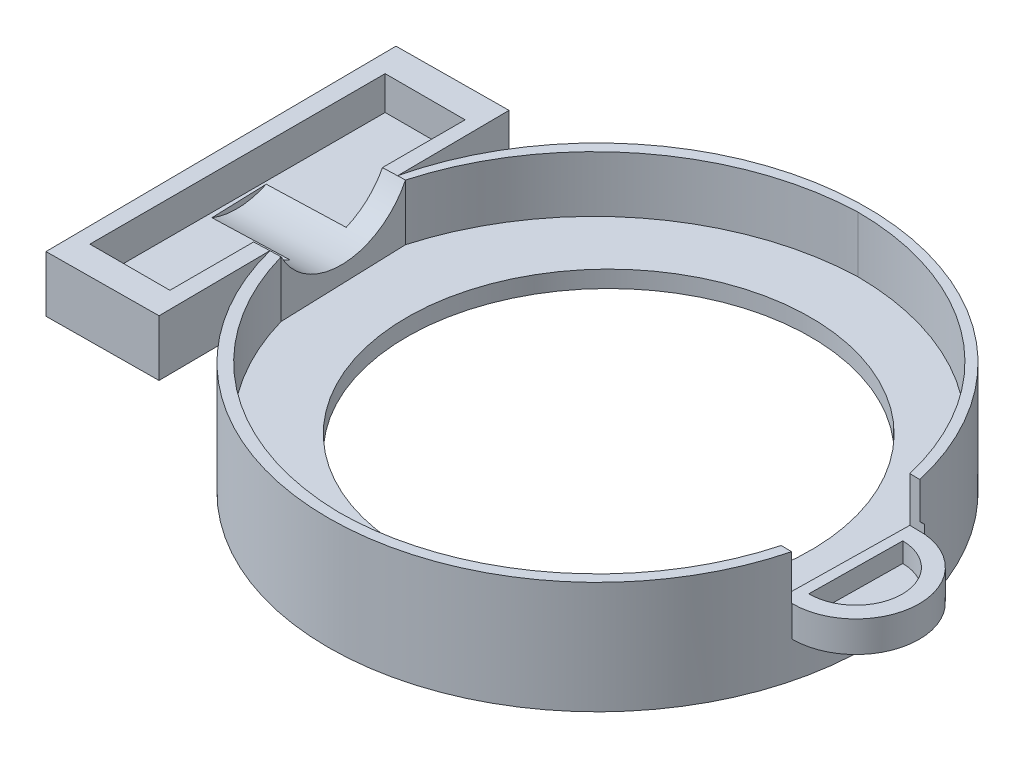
ISO-10303-21;
HEADER;
FILE_DESCRIPTION(('STEP AP214'),'2;1');
FILE_NAME('part.step','',(''),(''),'','','');
FILE_SCHEMA(('AUTOMOTIVE_DESIGN { 1 0 10303 214 1 1 1 1 }'));
ENDSEC;
DATA;
#1=APPLICATION_CONTEXT('core data for automotive mechanical design processes');
#2=APPLICATION_PROTOCOL_DEFINITION('international standard','automotive_design',2000,#1);
#3=PRODUCT_CONTEXT('',#1,'mechanical');
#4=PRODUCT('Part','Part','',(#3));
#5=PRODUCT_RELATED_PRODUCT_CATEGORY('part','',(#4));
#6=PRODUCT_DEFINITION_FORMATION('','',#4);
#7=PRODUCT_DEFINITION_CONTEXT('part definition',#1,'design');
#8=PRODUCT_DEFINITION('design','',#6,#7);
#9=PRODUCT_DEFINITION_SHAPE('','',#8);
#10=(LENGTH_UNIT() NAMED_UNIT(*) SI_UNIT(.MILLI.,.METRE.));
#11=(NAMED_UNIT(*) PLANE_ANGLE_UNIT() SI_UNIT($,.RADIAN.));
#12=(NAMED_UNIT(*) SI_UNIT($,.STERADIAN.) SOLID_ANGLE_UNIT());
#13=UNCERTAINTY_MEASURE_WITH_UNIT(LENGTH_MEASURE(1.E-05),#10,'distance_accuracy_value','');
#14=(GEOMETRIC_REPRESENTATION_CONTEXT(3) GLOBAL_UNCERTAINTY_ASSIGNED_CONTEXT((#13)) GLOBAL_UNIT_ASSIGNED_CONTEXT((#10,
#11,#12)) REPRESENTATION_CONTEXT('',''));
#15=CARTESIAN_POINT('',(0.,0.,0.));
#16=DIRECTION('',(0.,0.,1.));
#17=DIRECTION('',(1.,0.,0.));
#18=AXIS2_PLACEMENT_3D('',#15,#16,#17);
#19=CARTESIAN_POINT('',(-0.999999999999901,6.5,-1.28369537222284E-13));
#20=DIRECTION('',(0.,-1.,0.));
#21=DIRECTION('',(0.,0.,-1.));
#22=AXIS2_PLACEMENT_3D('',#19,#20,#21);
#23=PLANE('',#22);
#24=CARTESIAN_POINT('',(-0.999999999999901,6.5,-1.28369537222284E-13));
#25=DIRECTION('',(0.,1.,0.));
#26=DIRECTION('',(0.,0.,-1.));
#27=AXIS2_PLACEMENT_3D('',#24,#25,#26);
#28=CIRCLE('',#27,24.0000000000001);
#29=CARTESIAN_POINT('',(-24.2481450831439,6.5,5.96018038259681));
#30=VERTEX_POINT('',#29);
#31=CARTESIAN_POINT('',(22.2525469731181,6.5,5.94298403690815));
#32=VERTEX_POINT('',#31);
#33=EDGE_CURVE('E299',#30,#32,#28,.T.);
#34=ORIENTED_EDGE('',*,*,#33,.T.);
#35=DIRECTION('',(-0.999874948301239,0.,-0.0158141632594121));
#36=VECTOR('',#35,1.);
#37=CARTESIAN_POINT('',(29.3097798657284,6.5,6.054602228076));
#38=LINE('',#37,#36);
#39=CARTESIAN_POINT('',(21.3107802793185,6.5,5.9280889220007));
#40=VERTEX_POINT('',#39);
#41=EDGE_CURVE('E534',#32,#40,#38,.T.);
#42=ORIENTED_EDGE('',*,*,#41,.T.);
#43=CARTESIAN_POINT('',(-1.07181623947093,6.5,-0.0718162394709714));
#44=DIRECTION('',(0.,1.,0.));
#45=DIRECTION('',(0.,0.,-1.));
#46=AXIS2_PLACEMENT_3D('',#43,#44,#45);
#47=CIRCLE('',#46,23.1728178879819);
#48=CARTESIAN_POINT('',(9.29138296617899,6.5,20.6545821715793));
#49=VERTEX_POINT('',#48);
#50=EDGE_CURVE('E257',#49,#40,#47,.T.);
#51=ORIENTED_EDGE('',*,*,#50,.F.);
#52=CARTESIAN_POINT('',(-1.05036054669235,6.5,-0.0289048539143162));
#53=DIRECTION('',(0.,1.,0.));
#54=DIRECTION('',(0.,0.,-1.));
#55=AXIS2_PLACEMENT_3D('',#52,#53,#54);
#56=CIRCLE('',#55,23.1248415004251);
#57=CARTESIAN_POINT('',(-1.0264218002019,6.5,23.0959242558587));
#58=VERTEX_POINT('',#57);
#59=EDGE_CURVE('E261',#58,#49,#56,.T.);
#60=ORIENTED_EDGE('',*,*,#59,.F.);
#61=CARTESIAN_POINT('',(-0.565057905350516,6.5,-0.518210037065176));
#62=DIRECTION('',(0.,1.,0.));
#63=DIRECTION('',(0.,0.,-1.));
#64=AXIS2_PLACEMENT_3D('',#61,#62,#63);
#65=CIRCLE('',#64,23.618640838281);
#66=CARTESIAN_POINT('',(-23.2869729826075,6.5,5.92808892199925));
#67=VERTEX_POINT('',#66);
#68=EDGE_CURVE('E633',#67,#58,#65,.T.);
#69=ORIENTED_EDGE('',*,*,#68,.F.);
#70=DIRECTION('',(0.999443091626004,0.,-0.0333692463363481));
#71=VECTOR('',#70,1.);
#72=CARTESIAN_POINT('',(-32.2819608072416,6.5,6.22841213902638));
#73=LINE('',#72,#71);
#74=EDGE_CURVE('E428',#30,#67,#73,.T.);
#75=ORIENTED_EDGE('',*,*,#74,.F.);
#76=EDGE_LOOP('',(#34,#42,#51,#60,#69,#75));
#77=FACE_BOUND('',#76,.T.);
#78=ADVANCED_FACE('F36',(#77),#23,.F.);
#79=CARTESIAN_POINT('',(-1.,-3.5,0.));
#80=DIRECTION('',(0.,1.,0.));
#81=DIRECTION('',(0.,0.,1.));
#82=AXIS2_PLACEMENT_3D('',#79,#80,#81);
#83=CYLINDRICAL_SURFACE('',#82,24.);
#84=DIRECTION('',(0.,1.,0.));
#85=VECTOR('',#84,1.);
#86=CARTESIAN_POINT('',(22.2525469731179,-3.5,5.94298403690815));
#87=LINE('',#86,#85);
#88=CARTESIAN_POINT('',(22.2525469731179,2.5,5.94298403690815));
#89=VERTEX_POINT('',#88);
#90=EDGE_CURVE('E541',#32,#89,#87,.F.);
#91=ORIENTED_EDGE('',*,*,#90,.F.);
#92=ORIENTED_EDGE('',*,*,#33,.F.);
#93=CARTESIAN_POINT('',(-24.356378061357,6.5,-5.52083361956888));
#94=CARTESIAN_POINT('',(-24.3763088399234,6.33682907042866,-5.43649804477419));
#95=CARTESIAN_POINT('',(-24.3974061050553,6.17740725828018,-5.34522168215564));
#96=CARTESIAN_POINT('',(-24.4412466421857,5.8670878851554,-5.14956792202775));
#97=CARTESIAN_POINT('',(-24.4639896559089,5.71618899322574,-5.045192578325));
#98=CARTESIAN_POINT('',(-24.5104343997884,5.42393375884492,-4.82412779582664));
#99=CARTESIAN_POINT('',(-24.5341358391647,5.28257455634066,-4.70744207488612));
#100=CARTESIAN_POINT('',(-24.581797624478,5.01025383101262,-4.46255322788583));
#101=CARTESIAN_POINT('',(-24.6057579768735,4.87929256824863,-4.33434981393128));
#102=CARTESIAN_POINT('',(-24.6532313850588,4.62864137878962,-4.06731219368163));
#103=CARTESIAN_POINT('',(-24.6767444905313,4.5089501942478,-3.92847917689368));
#104=CARTESIAN_POINT('',(-24.7226472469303,4.28158646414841,-3.64104279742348));
#105=CARTESIAN_POINT('',(-24.7450365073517,4.17391808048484,-3.4924360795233));
#106=CARTESIAN_POINT('',(-24.7880186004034,3.97144093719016,-3.18653630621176));
#107=CARTESIAN_POINT('',(-24.8086120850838,3.87662750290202,-3.02924643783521));
#108=CARTESIAN_POINT('',(-24.8474009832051,3.70052034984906,-2.7069908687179));
#109=CARTESIAN_POINT('',(-24.8655964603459,3.61922627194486,-2.54202537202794));
#110=CARTESIAN_POINT('',(-24.899013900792,3.47091506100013,-2.20581594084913));
#111=CARTESIAN_POINT('',(-24.9142405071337,3.40387561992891,-2.03458231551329));
#112=CARTESIAN_POINT('',(-24.9412795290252,3.28449841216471,-1.68686929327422));
#113=CARTESIAN_POINT('',(-24.9530931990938,3.23215524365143,-1.51039185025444));
#114=CARTESIAN_POINT('',(-24.9729349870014,3.14260321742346,-1.15340662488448));
#115=CARTESIAN_POINT('',(-24.9809627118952,3.1053959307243,-0.972898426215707));
#116=CARTESIAN_POINT('',(-24.9929556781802,3.04648123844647,-0.609237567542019));
#117=CARTESIAN_POINT('',(-24.9969210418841,3.02477336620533,-0.426084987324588));
#118=CARTESIAN_POINT('',(-25.0005709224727,2.99753875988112,-0.0646305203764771));
#119=CARTESIAN_POINT('',(-25.0003925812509,2.99150098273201,0.113631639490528));
#120=CARTESIAN_POINT('',(-24.996058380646,2.99420219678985,0.470059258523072));
#121=CARTESIAN_POINT('',(-24.9919011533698,3.00294627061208,0.648224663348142));
#122=CARTESIAN_POINT('',(-24.979689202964,3.03515847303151,1.00299267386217));
#123=CARTESIAN_POINT('',(-24.9716364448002,3.05861918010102,1.1795960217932));
#124=CARTESIAN_POINT('',(-24.9518183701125,3.12008519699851,1.53010481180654));
#125=CARTESIAN_POINT('',(-24.9400517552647,3.15809559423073,1.70400928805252));
#126=CARTESIAN_POINT('',(-24.9133142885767,3.24762703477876,2.04503936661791));
#127=CARTESIAN_POINT('',(-24.8983980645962,3.29892074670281,2.21222902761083));
#128=CARTESIAN_POINT('',(-24.8656166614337,3.41489753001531,2.54160071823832));
#129=CARTESIAN_POINT('',(-24.8477514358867,3.47958081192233,2.7037826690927));
#130=CARTESIAN_POINT('',(-24.8095022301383,3.62188266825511,3.02213848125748));
#131=CARTESIAN_POINT('',(-24.7891172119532,3.69950657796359,3.17830983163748));
#132=CARTESIAN_POINT('',(-24.746341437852,3.86708645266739,3.48353457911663));
#133=CARTESIAN_POINT('',(-24.7239512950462,3.95703865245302,3.63259013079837));
#134=CARTESIAN_POINT('',(-24.6772085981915,4.15074622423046,3.92585223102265));
#135=CARTESIAN_POINT('',(-24.6528241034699,4.25475776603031,4.06988450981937));
#136=CARTESIAN_POINT('',(-24.603160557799,4.47427066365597,4.3486613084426));
#137=CARTESIAN_POINT('',(-24.5778818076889,4.58976817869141,4.48340890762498));
#138=CARTESIAN_POINT('',(-24.5270809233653,4.83146454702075,4.74277590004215));
#139=CARTESIAN_POINT('',(-24.5015589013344,4.95765866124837,4.8673997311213));
#140=CARTESIAN_POINT('',(-24.450926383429,5.21993110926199,5.10577055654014));
#141=CARTESIAN_POINT('',(-24.4258157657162,5.35600644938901,5.21952082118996));
#142=CARTESIAN_POINT('',(-24.3737968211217,5.65357248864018,5.44802023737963));
#143=CARTESIAN_POINT('',(-24.3470185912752,5.81617920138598,5.56134995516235));
#144=CARTESIAN_POINT('',(-24.2957008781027,6.15109630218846,5.77252496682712));
#145=CARTESIAN_POINT('',(-24.2711577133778,6.32338994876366,5.87039592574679));
#146=CARTESIAN_POINT('',(-24.2481450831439,6.5,5.96018038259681));
#147=B_SPLINE_CURVE_WITH_KNOTS('',3,(#93,#94,#95,#96,#97,#98,#99,#100,#101,#102,#103,#104,#105,
#106,#107,#108,#109,#110,#111,#112,#113,#114,#115,#116,#117,#118,#119,#120,#121,#122,#123,#124,
#125,#126,#127,#128,#129,#130,#131,#132,#133,#134,#135,#136,#137,#138,#139,#140,#141,#142,#143,
#144,#145,#146),.UNSPECIFIED.,.F.,.F.,(4,2,2,2,2,2,2,2,2,2,2,2,2,2,2,2,2,2,2,2,2,2,2,2,2,2,4),
(0.,0.554071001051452,1.10805523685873,1.66187264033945,2.21570389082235,2.76947325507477,
3.32343372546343,3.87719220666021,4.4309359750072,4.98380666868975,5.53647388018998,
6.08919844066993,6.64190635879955,7.17634847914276,7.71097440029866,8.24533092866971,
8.77987446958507,9.3058134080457,9.8317606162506,10.3579252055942,10.8839294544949,
11.4212948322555,11.9584811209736,12.4954306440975,13.0322181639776,13.6313719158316,
14.2295202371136),.UNSPECIFIED.);
#148=CARTESIAN_POINT('',(-24.2563488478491,6.43773181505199,5.92808892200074));
#149=VERTEX_POINT('',#148);
#150=EDGE_CURVE('E427',#149,#30,#147,.T.);
#151=ORIENTED_EDGE('',*,*,#150,.F.);
#152=DIRECTION('',(0.,-1.,0.));
#153=VECTOR('',#152,1.);
#154=CARTESIAN_POINT('',(-24.2563488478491,6.5,5.92808892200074));
#155=LINE('',#154,#153);
#156=CARTESIAN_POINT('',(-24.2563488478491,1.5,5.92808892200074));
#157=VERTEX_POINT('',#156);
#158=EDGE_CURVE('E307',#149,#157,#155,.T.);
#159=ORIENTED_EDGE('',*,*,#158,.T.);
#160=CARTESIAN_POINT('',(-1.,1.5,0.));
#161=DIRECTION('',(0.,1.,0.));
#162=DIRECTION('',(0.,0.,1.));
#163=AXIS2_PLACEMENT_3D('',#160,#161,#162);
#164=CIRCLE('',#163,24.);
#165=CARTESIAN_POINT('',(-24.3509492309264,1.5,-5.54375053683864));
#166=VERTEX_POINT('',#165);
#167=EDGE_CURVE('E320',#166,#157,#164,.T.);
#168=ORIENTED_EDGE('',*,*,#167,.F.);
#169=DIRECTION('',(0.,-1.,0.));
#170=VECTOR('',#169,1.);
#171=CARTESIAN_POINT('',(-24.3509492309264,6.5,-5.54375053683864));
#172=LINE('',#171,#170);
#173=CARTESIAN_POINT('',(-24.3509492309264,6.5,-5.54375053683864));
#174=VERTEX_POINT('',#173);
#175=EDGE_CURVE('E309',#174,#166,#172,.T.);
#176=ORIENTED_EDGE('',*,*,#175,.F.);
#177=CARTESIAN_POINT('',(-1.0000000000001,6.5,0.));
#178=DIRECTION('',(0.,1.,0.));
#179=DIRECTION('',(0.,0.,-1.));
#180=AXIS2_PLACEMENT_3D('',#177,#178,#179);
#181=CIRCLE('',#180,24.0000000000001);
#182=CARTESIAN_POINT('',(22.3936083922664,6.5,-5.36088485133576));
#183=VERTEX_POINT('',#182);
#184=EDGE_CURVE('E304',#183,#174,#181,.T.);
#185=ORIENTED_EDGE('',*,*,#184,.F.);
#186=DIRECTION('',(0.,-1.,0.));
#187=VECTOR('',#186,1.);
#188=CARTESIAN_POINT('',(22.3936083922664,6.5,-5.36088485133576));
#189=LINE('',#188,#187);
#190=CARTESIAN_POINT('',(22.3936083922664,3.25,-5.36088485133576));
#191=VERTEX_POINT('',#190);
#192=EDGE_CURVE('E311',#183,#191,#189,.T.);
#193=ORIENTED_EDGE('',*,*,#192,.T.);
#194=DIRECTION('',(0.,-1.,0.));
#195=VECTOR('',#194,1.);
#196=CARTESIAN_POINT('',(22.3936083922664,3.25,-5.36088485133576));
#197=LINE('',#196,#195);
#198=CARTESIAN_POINT('',(22.3936083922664,-0.25,-5.36088485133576));
#199=VERTEX_POINT('',#198);
#200=EDGE_CURVE('E378',#191,#199,#197,.T.);
#201=ORIENTED_EDGE('',*,*,#200,.T.);
#202=CARTESIAN_POINT('',(-1.,-0.25,0.));
#203=DIRECTION('',(0.,-1.,0.));
#204=DIRECTION('',(0.,0.,-1.));
#205=AXIS2_PLACEMENT_3D('',#202,#203,#204);
#206=CIRCLE('',#205,24.);
#207=CARTESIAN_POINT('',(22.2563488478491,-0.25,5.92808892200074));
#208=VERTEX_POINT('',#207);
#209=EDGE_CURVE('E348',#208,#199,#206,.F.);
#210=ORIENTED_EDGE('',*,*,#209,.F.);
#211=DIRECTION('',(0.,-1.,0.));
#212=VECTOR('',#211,1.);
#213=CARTESIAN_POINT('',(22.2563488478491,3.25,5.92808892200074));
#214=LINE('',#213,#212);
#215=CARTESIAN_POINT('',(22.2563488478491,2.5,5.92808892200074));
#216=VERTEX_POINT('',#215);
#217=EDGE_CURVE('E374',#216,#208,#214,.T.);
#218=ORIENTED_EDGE('',*,*,#217,.F.);
#219=CARTESIAN_POINT('',(-1.,2.5,0.));
#220=DIRECTION('',(0.,-1.,0.));
#221=DIRECTION('',(0.,0.,-1.));
#222=AXIS2_PLACEMENT_3D('',#219,#220,#221);
#223=CIRCLE('',#222,24.);
#224=EDGE_CURVE('E543',#89,#216,#223,.F.);
#225=ORIENTED_EDGE('',*,*,#224,.F.);
#226=EDGE_LOOP('',(#91,#92,#151,#159,#168,#176,#185,#193,#201,#210,#218,#225));
#227=FACE_BOUND('',#226,.T.);
#228=CARTESIAN_POINT('',(-1.,-3.5,0.));
#229=DIRECTION('',(0.,1.,0.));
#230=DIRECTION('',(0.,0.,1.));
#231=AXIS2_PLACEMENT_3D('',#228,#229,#230);
#232=CIRCLE('',#231,24.);
#233=CARTESIAN_POINT('',(-1.,-3.5,24.));
#234=VERTEX_POINT('',#233);
#235=EDGE_CURVE('E321',#234,#234,#232,.T.);
#236=ORIENTED_EDGE('',*,*,#235,.T.);
#237=EDGE_LOOP('',(#236));
#238=FACE_BOUND('',#237,.T.);
#239=ADVANCED_FACE('F440',(#227,#238),#83,.T.);
#240=CARTESIAN_POINT('',(22.3936083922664,6.5,-5.36088485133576));
#241=DIRECTION('',(-0.999926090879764,0.,-0.0121578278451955));
#242=DIRECTION('',(-0.0121578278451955,0.,0.999926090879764));
#243=AXIS2_PLACEMENT_3D('',#240,#241,#242);
#244=PLANE('',#243);
#245=DIRECTION('',(0.0121578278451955,0.,-0.999926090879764));
#246=VECTOR('',#245,1.);
#247=CARTESIAN_POINT('',(22.3936083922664,6.5,-5.36088485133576));
#248=LINE('',#247,#246);
#249=CARTESIAN_POINT('',(22.3934345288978,6.5,-5.34658537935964));
#250=VERTEX_POINT('',#249);
#251=EDGE_CURVE('E302',#250,#183,#248,.T.);
#252=ORIENTED_EDGE('',*,*,#251,.F.);
#253=DIRECTION('',(0.,-1.,0.));
#254=VECTOR('',#253,1.);
#255=CARTESIAN_POINT('',(22.3934345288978,6.5,-5.34658537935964));
#256=LINE('',#255,#254);
#257=CARTESIAN_POINT('',(22.3934345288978,3.25,-5.34658537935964));
#258=VERTEX_POINT('',#257);
#259=EDGE_CURVE('E235',#250,#258,#256,.T.);
#260=ORIENTED_EDGE('',*,*,#259,.T.);
#261=DIRECTION('',(-0.0121578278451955,0.,0.999926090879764));
#262=VECTOR('',#261,1.);
#263=CARTESIAN_POINT('',(22.3936083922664,3.25,-5.36088485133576));
#264=LINE('',#263,#262);
#265=EDGE_CURVE('E371',#191,#258,#264,.T.);
#266=ORIENTED_EDGE('',*,*,#265,.F.);
#267=ORIENTED_EDGE('',*,*,#192,.F.);
#268=EDGE_LOOP('',(#252,#260,#266,#267));
#269=FACE_BOUND('',#268,.T.);
#270=ADVANCED_FACE('F503',(#269),#244,.F.);
#271=CARTESIAN_POINT('',(-32.4734707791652,9.44184431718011,0.492492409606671));
#272=DIRECTION('',(0.999443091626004,0.,-0.0333692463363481));
#273=DIRECTION('',(-0.0333692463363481,0.,-0.999443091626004));
#274=AXIS2_PLACEMENT_3D('',#271,#272,#273);
#275=PLANE('',#274);
#276=CARTESIAN_POINT('',(-32.4734707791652,9.44184431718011,0.492492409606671));
#277=DIRECTION('',(0.999443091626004,0.,-0.0333692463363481));
#278=DIRECTION('',(-0.0333692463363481,0.,-0.999443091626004));
#279=AXIS2_PLACEMENT_3D('',#276,#277,#278);
#280=CIRCLE('',#279,6.44917818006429);
#281=CARTESIAN_POINT('',(-32.3898051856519,3.5,2.99836259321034));
#282=VERTEX_POINT('',#281);
#283=CARTESIAN_POINT('',(-32.5571363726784,3.5,-2.013377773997));
#284=VERTEX_POINT('',#283);
#285=EDGE_CURVE('E419',#282,#284,#280,.T.);
#286=ORIENTED_EDGE('',*,*,#285,.T.);
#287=DIRECTION('',(0.0333692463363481,0.,0.999443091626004));
#288=VECTOR('',#287,1.);
#289=CARTESIAN_POINT('',(-32.4734707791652,3.5,0.492492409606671));
#290=LINE('',#289,#288);
#291=EDGE_CURVE('E341',#284,#282,#290,.T.);
#292=ORIENTED_EDGE('',*,*,#291,.T.);
#293=EDGE_LOOP('',(#286,#292));
#294=FACE_BOUND('',#293,.T.);
#295=ADVANCED_FACE('F452',(#294),#275,.T.);
#296=CARTESIAN_POINT('',(-1.,1.5,0.));
#297=DIRECTION('',(0.,1.,0.));
#298=DIRECTION('',(0.,0.,1.));
#299=AXIS2_PLACEMENT_3D('',#296,#297,#298);
#300=PLANE('',#299);
#301=CARTESIAN_POINT('',(0.,1.5,0.));
#302=DIRECTION('',(0.,1.,0.));
#303=DIRECTION('',(0.,0.,1.));
#304=AXIS2_PLACEMENT_3D('',#301,#302,#303);
#305=CIRCLE('',#304,18.);
#306=CARTESIAN_POINT('',(0.,1.5,18.));
#307=VERTEX_POINT('',#306);
#308=EDGE_CURVE('E327',#307,#307,#305,.T.);
#309=ORIENTED_EDGE('',*,*,#308,.F.);
#310=EDGE_LOOP('',(#309));
#311=FACE_BOUND('',#310,.T.);
#312=DIRECTION('',(0.0158141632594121,0.,-0.999874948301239));
#313=VECTOR('',#312,1.);
#314=CARTESIAN_POINT('',(21.4893282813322,1.5,-5.36088485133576));
#315=LINE('',#314,#313);
#316=CARTESIAN_POINT('',(21.3107802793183,1.5,5.9280889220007));
#317=VERTEX_POINT('',#316);
#318=CARTESIAN_POINT('',(21.4893282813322,1.5,-5.36088485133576));
#319=VERTEX_POINT('',#318);
#320=EDGE_CURVE('E281',#317,#319,#315,.T.);
#321=ORIENTED_EDGE('',*,*,#320,.T.);
#322=CARTESIAN_POINT('',(-1.07181623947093,1.5,-0.0718162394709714));
#323=DIRECTION('',(0.,1.,0.));
#324=DIRECTION('',(0.,0.,-1.));
#325=AXIS2_PLACEMENT_3D('',#322,#323,#324);
#326=CIRCLE('',#325,23.172817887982);
#327=CARTESIAN_POINT('',(-0.999999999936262,1.5,-23.244522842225));
#328=VERTEX_POINT('',#327);
#329=EDGE_CURVE('E284',#319,#328,#326,.T.);
#330=ORIENTED_EDGE('',*,*,#329,.T.);
#331=CARTESIAN_POINT('',(-0.268255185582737,1.5,1.06015732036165));
#332=DIRECTION('',(0.,1.,0.));
#333=DIRECTION('',(0.,0.,-1.));
#334=AXIS2_PLACEMENT_3D('',#331,#332,#333);
#335=CIRCLE('',#334,24.3156930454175);
#336=CARTESIAN_POINT('',(-23.6699929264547,1.5,-5.54375053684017));
#337=VERTEX_POINT('',#336);
#338=EDGE_CURVE('E265',#328,#337,#335,.T.);
#339=ORIENTED_EDGE('',*,*,#338,.T.);
#340=DIRECTION('',(0.0333692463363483,0.,0.999443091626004));
#341=VECTOR('',#340,1.);
#342=CARTESIAN_POINT('',(-23.6699929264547,1.5,-5.54375053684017));
#343=LINE('',#342,#341);
#344=CARTESIAN_POINT('',(-23.2869729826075,1.5,5.92808892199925));
#345=VERTEX_POINT('',#344);
#346=EDGE_CURVE('E268',#337,#345,#343,.T.);
#347=ORIENTED_EDGE('',*,*,#346,.T.);
#348=CARTESIAN_POINT('',(-0.565057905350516,1.5,-0.518210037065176));
#349=DIRECTION('',(0.,1.,0.));
#350=DIRECTION('',(0.,0.,-1.));
#351=AXIS2_PLACEMENT_3D('',#348,#349,#350);
#352=CIRCLE('',#351,23.618640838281);
#353=CARTESIAN_POINT('',(-1.0264218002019,1.5,23.0959242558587));
#354=VERTEX_POINT('',#353);
#355=EDGE_CURVE('E272',#345,#354,#352,.T.);
#356=ORIENTED_EDGE('',*,*,#355,.T.);
#357=CARTESIAN_POINT('',(-1.05036054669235,1.5,-0.0289048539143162));
#358=DIRECTION('',(0.,1.,0.));
#359=DIRECTION('',(0.,0.,-1.));
#360=AXIS2_PLACEMENT_3D('',#357,#358,#359);
#361=CIRCLE('',#360,23.1248415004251);
#362=CARTESIAN_POINT('',(9.29138296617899,1.5,20.6545821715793));
#363=VERTEX_POINT('',#362);
#364=EDGE_CURVE('E275',#354,#363,#361,.T.);
#365=ORIENTED_EDGE('',*,*,#364,.T.);
#366=CARTESIAN_POINT('',(-1.07181623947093,1.5,-0.0718162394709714));
#367=DIRECTION('',(0.,1.,0.));
#368=DIRECTION('',(0.,0.,-1.));
#369=AXIS2_PLACEMENT_3D('',#366,#367,#368);
#370=CIRCLE('',#369,23.1728178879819);
#371=EDGE_CURVE('E278',#363,#317,#370,.T.);
#372=ORIENTED_EDGE('',*,*,#371,.T.);
#373=EDGE_LOOP('',(#321,#330,#339,#347,#356,#365,#372));
#374=FACE_BOUND('',#373,.T.);
#375=ADVANCED_FACE('F637',(#311,#374),#300,.T.);
#376=CARTESIAN_POINT('',(-1.,0.,0.));
#377=DIRECTION('',(0.,1.,0.));
#378=DIRECTION('',(0.,0.,1.));
#379=AXIS2_PLACEMENT_3D('',#376,#377,#378);
#380=PLANE('',#379);
#381=CARTESIAN_POINT('',(-22.,0.,0.));
#382=DIRECTION('',(0.,1.,0.));
#383=DIRECTION('',(0.,0.,1.));
#384=AXIS2_PLACEMENT_3D('',#381,#382,#383);
#385=CIRCLE('',#384,1.25);
#386=CARTESIAN_POINT('',(-22.,0.,1.25));
#387=VERTEX_POINT('',#386);
#388=EDGE_CURVE('E335',#387,#387,#385,.F.);
#389=ORIENTED_EDGE('',*,*,#388,.F.);
#390=EDGE_LOOP('',(#389));
#391=FACE_BOUND('',#390,.T.);
#392=CARTESIAN_POINT('',(-1.,0.,0.));
#393=DIRECTION('',(0.,1.,0.));
#394=DIRECTION('',(0.,0.,1.));
#395=AXIS2_PLACEMENT_3D('',#392,#393,#394);
#396=CIRCLE('',#395,23.2);
#397=CARTESIAN_POINT('',(-1.,0.,23.2));
#398=VERTEX_POINT('',#397);
#399=EDGE_CURVE('E330',#398,#398,#396,.T.);
#400=ORIENTED_EDGE('',*,*,#399,.F.);
#401=EDGE_LOOP('',(#400));
#402=FACE_BOUND('',#401,.T.);
#403=CARTESIAN_POINT('',(0.,0.,0.));
#404=DIRECTION('',(0.,1.,0.));
#405=DIRECTION('',(0.,0.,1.));
#406=AXIS2_PLACEMENT_3D('',#403,#404,#405);
#407=CIRCLE('',#406,18.);
#408=CARTESIAN_POINT('',(0.,0.,18.));
#409=VERTEX_POINT('',#408);
#410=EDGE_CURVE('E324',#409,#409,#407,.T.);
#411=ORIENTED_EDGE('',*,*,#410,.T.);
#412=EDGE_LOOP('',(#411));
#413=FACE_BOUND('',#412,.T.);
#414=ADVANCED_FACE('F38',(#391,#402,#413),#380,.F.);
#415=CARTESIAN_POINT('',(0.,1.5,0.));
#416=DIRECTION('',(0.,-1.,0.));
#417=DIRECTION('',(0.,0.,-1.));
#418=AXIS2_PLACEMENT_3D('',#415,#416,#417);
#419=CYLINDRICAL_SURFACE('',#418,18.);
#420=ORIENTED_EDGE('',*,*,#308,.T.);
#421=EDGE_LOOP('',(#420));
#422=FACE_BOUND('',#421,.T.);
#423=ORIENTED_EDGE('',*,*,#410,.F.);
#424=EDGE_LOOP('',(#423));
#425=FACE_BOUND('',#424,.T.);
#426=ADVANCED_FACE('F517',(#422,#425),#419,.F.);
#427=CARTESIAN_POINT('',(-1.,-3.5,0.));
#428=DIRECTION('',(0.,1.,0.));
#429=DIRECTION('',(0.,0.,1.));
#430=AXIS2_PLACEMENT_3D('',#427,#428,#429);
#431=CYLINDRICAL_SURFACE('',#430,23.2);
#432=CARTESIAN_POINT('',(-1.,-3.5,0.));
#433=DIRECTION('',(0.,1.,0.));
#434=DIRECTION('',(0.,0.,1.));
#435=AXIS2_PLACEMENT_3D('',#432,#433,#434);
#436=CIRCLE('',#435,23.2);
#437=CARTESIAN_POINT('',(-1.,-3.5,23.2));
#438=VERTEX_POINT('',#437);
#439=EDGE_CURVE('E317',#438,#438,#436,.T.);
#440=ORIENTED_EDGE('',*,*,#439,.F.);
#441=EDGE_LOOP('',(#440));
#442=FACE_BOUND('',#441,.T.);
#443=ORIENTED_EDGE('',*,*,#399,.T.);
#444=EDGE_LOOP('',(#443));
#445=FACE_BOUND('',#444,.T.);
#446=ADVANCED_FACE('F515',(#442,#445),#431,.F.);
#447=CARTESIAN_POINT('',(-1.,-3.5,0.));
#448=DIRECTION('',(0.,1.,0.));
#449=DIRECTION('',(0.,0.,1.));
#450=AXIS2_PLACEMENT_3D('',#447,#448,#449);
#451=PLANE('',#450);
#452=ORIENTED_EDGE('',*,*,#439,.T.);
#453=EDGE_LOOP('',(#452));
#454=FACE_BOUND('',#453,.T.);
#455=ORIENTED_EDGE('',*,*,#235,.F.);
#456=EDGE_LOOP('',(#455));
#457=FACE_BOUND('',#456,.T.);
#458=ADVANCED_FACE('F513',(#454,#457),#451,.F.);
#459=CARTESIAN_POINT('',(-22.,-0.45,0.));
#460=DIRECTION('',(0.,1.,0.));
#461=DIRECTION('',(0.,0.,1.));
#462=AXIS2_PLACEMENT_3D('',#459,#460,#461);
#463=CYLINDRICAL_SURFACE('',#462,1.25);
#464=CARTESIAN_POINT('',(-22.,-0.45,0.));
#465=DIRECTION('',(0.,-1.,0.));
#466=DIRECTION('',(0.,0.,-1.));
#467=AXIS2_PLACEMENT_3D('',#464,#465,#466);
#468=CIRCLE('',#467,1.25);
#469=CARTESIAN_POINT('',(-22.,-0.45,-1.25));
#470=VERTEX_POINT('',#469);
#471=EDGE_CURVE('E314',#470,#470,#468,.T.);
#472=ORIENTED_EDGE('',*,*,#471,.F.);
#473=EDGE_LOOP('',(#472));
#474=FACE_BOUND('',#473,.T.);
#475=ORIENTED_EDGE('',*,*,#388,.T.);
#476=EDGE_LOOP('',(#475));
#477=FACE_BOUND('',#476,.T.);
#478=ADVANCED_FACE('F509',(#474,#477),#463,.T.);
#479=CARTESIAN_POINT('',(-22.,-0.45,0.));
#480=DIRECTION('',(0.,-1.,0.));
#481=DIRECTION('',(0.,0.,-1.));
#482=AXIS2_PLACEMENT_3D('',#479,#480,#481);
#483=PLANE('',#482);
#484=ORIENTED_EDGE('',*,*,#471,.T.);
#485=EDGE_LOOP('',(#484));
#486=FACE_BOUND('',#485,.T.);
#487=ADVANCED_FACE('F502',(#486),#483,.T.);
#488=CARTESIAN_POINT('',(-1.07181623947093,6.5,-0.0718162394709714));
#489=DIRECTION('',(0.,1.,0.));
#490=DIRECTION('',(0.,0.,-1.));
#491=AXIS2_PLACEMENT_3D('',#488,#489,#490);
#492=CIRCLE('',#491,23.172817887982);
#493=CARTESIAN_POINT('',(21.4893282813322,6.5,-5.36088485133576));
#494=VERTEX_POINT('',#493);
#495=CARTESIAN_POINT('',(-0.999999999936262,6.5,-23.244522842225));
#496=VERTEX_POINT('',#495);
#497=EDGE_CURVE('E247',#494,#496,#492,.T.);
#498=ORIENTED_EDGE('',*,*,#497,.F.);
#499=DIRECTION('',(-0.999874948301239,0.,-0.0158141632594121));
#500=VECTOR('',#499,1.);
#501=CARTESIAN_POINT('',(29.4883278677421,6.5,-5.23437154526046));
#502=LINE('',#501,#500);
#503=EDGE_CURVE('E229',#250,#494,#502,.T.);
#504=ORIENTED_EDGE('',*,*,#503,.F.);
#505=ORIENTED_EDGE('',*,*,#251,.T.);
#506=ORIENTED_EDGE('',*,*,#184,.T.);
#507=DIRECTION('',(-0.00824603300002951,0.,-0.999966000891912));
#508=VECTOR('',#507,1.);
#509=CARTESIAN_POINT('',(-24.4334095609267,6.5,-15.5434105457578));
#510=LINE('',#509,#508);
#511=CARTESIAN_POINT('',(-24.4334095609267,6.5,-15.5434105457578));
#512=VERTEX_POINT('',#511);
#513=EDGE_CURVE('E658',#174,#512,#510,.T.);
#514=ORIENTED_EDGE('',*,*,#513,.T.);
#515=DIRECTION('',(0.999966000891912,0.,-0.0082460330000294));
#516=VECTOR('',#515,1.);
#517=CARTESIAN_POINT('',(-34.4330695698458,6.5,-15.4609502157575));
#518=LINE('',#517,#516);
#519=CARTESIAN_POINT('',(-34.4330695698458,6.5,-15.4609502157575));
#520=VERTEX_POINT('',#519);
#521=EDGE_CURVE('E651',#520,#512,#518,.T.);
#522=ORIENTED_EDGE('',*,*,#521,.F.);
#523=DIRECTION('',(-0.00824603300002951,0.,-0.999966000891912));
#524=VECTOR('',#523,1.);
#525=CARTESIAN_POINT('',(-34.4330695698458,6.5,-15.4609502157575));
#526=LINE('',#525,#524);
#527=CARTESIAN_POINT('',(-34.1735485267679,6.5,16.0102092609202));
#528=VERTEX_POINT('',#527);
#529=EDGE_CURVE('E654',#528,#520,#526,.T.);
#530=ORIENTED_EDGE('',*,*,#529,.F.);
#531=DIRECTION('',(0.999966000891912,0.,-0.0082460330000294));
#532=VECTOR('',#531,1.);
#533=CARTESIAN_POINT('',(-34.1735485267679,6.5,16.0102092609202));
#534=LINE('',#533,#532);
#535=CARTESIAN_POINT('',(-24.1738885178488,6.5,15.9277489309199));
#536=VERTEX_POINT('',#535);
#537=EDGE_CURVE('E648',#528,#536,#534,.T.);
#538=ORIENTED_EDGE('',*,*,#537,.T.);
#539=CARTESIAN_POINT('',(-24.2560820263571,6.5,5.96044537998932));
#540=VERTEX_POINT('',#539);
#541=EDGE_CURVE('E655',#536,#540,#510,.T.);
#542=ORIENTED_EDGE('',*,*,#541,.T.);
#543=CARTESIAN_POINT('',(-25.657510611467,6.5,6.00723605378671));
#544=VERTEX_POINT('',#543);
#545=EDGE_CURVE('E425',#544,#540,#73,.T.);
#546=ORIENTED_EDGE('',*,*,#545,.F.);
#547=DIRECTION('',(0.,0.,-1.));
#548=VECTOR('',#547,1.);
#549=CARTESIAN_POINT('',(-25.657510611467,6.5,-12.8551068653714));
#550=LINE('',#549,#548);
#551=CARTESIAN_POINT('',(-25.657510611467,6.5,13.4775142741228));
#552=VERTEX_POINT('',#551);
#553=EDGE_CURVE('E402',#552,#544,#550,.T.);
#554=ORIENTED_EDGE('',*,*,#553,.F.);
#555=DIRECTION('',(1.,0.,0.));
#556=VECTOR('',#555,1.);
#557=CARTESIAN_POINT('',(-32.7912570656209,6.5,13.4775142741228));
#558=LINE('',#557,#556);
#559=CARTESIAN_POINT('',(-32.7912570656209,6.5,13.4775142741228));
#560=VERTEX_POINT('',#559);
#561=EDGE_CURVE('E398',#560,#552,#558,.T.);
#562=ORIENTED_EDGE('',*,*,#561,.F.);
#563=DIRECTION('',(0.,0.,1.));
#564=VECTOR('',#563,1.);
#565=CARTESIAN_POINT('',(-32.7912570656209,6.5,-12.8551068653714));
#566=LINE('',#565,#564);
#567=CARTESIAN_POINT('',(-32.7912570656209,6.5,-12.8551068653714));
#568=VERTEX_POINT('',#567);
#569=EDGE_CURVE('E380',#568,#560,#566,.T.);
#570=ORIENTED_EDGE('',*,*,#569,.F.);
#571=DIRECTION('',(-1.,0.,0.));
#572=VECTOR('',#571,1.);
#573=CARTESIAN_POINT('',(-32.7912570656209,6.5,-12.8551068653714));
#574=LINE('',#573,#572);
#575=CARTESIAN_POINT('',(-25.657510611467,6.5,-12.8551068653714));
#576=VERTEX_POINT('',#575);
#577=EDGE_CURVE('E385',#576,#568,#574,.T.);
#578=ORIENTED_EDGE('',*,*,#577,.F.);
#579=CARTESIAN_POINT('',(-25.657510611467,6.5,-5.47739161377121));
#580=VERTEX_POINT('',#579);
#581=EDGE_CURVE('E401',#580,#576,#550,.T.);
#582=ORIENTED_EDGE('',*,*,#581,.F.);
#583=DIRECTION('',(0.999443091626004,0.,-0.0333692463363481));
#584=VECTOR('',#583,1.);
#585=CARTESIAN_POINT('',(-32.6649807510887,6.5,-5.24342731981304));
#586=LINE('',#585,#584);
#587=CARTESIAN_POINT('',(-23.6699929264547,6.5,-5.54375053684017));
#588=VERTEX_POINT('',#587);
#589=EDGE_CURVE('E422',#580,#588,#586,.T.);
#590=ORIENTED_EDGE('',*,*,#589,.T.);
#591=CARTESIAN_POINT('',(-0.268255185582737,6.5,1.06015732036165));
#592=DIRECTION('',(0.,1.,0.));
#593=DIRECTION('',(0.,0.,-1.));
#594=AXIS2_PLACEMENT_3D('',#591,#592,#593);
#595=CIRCLE('',#594,24.3156930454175);
#596=EDGE_CURVE('E255',#496,#588,#595,.T.);
#597=ORIENTED_EDGE('',*,*,#596,.F.);
#598=EDGE_LOOP('',(#498,#504,#505,#506,#514,#522,#530,#538,#542,#546,#554,#562,#570,#578,#582,
#590,#597));
#599=FACE_BOUND('',#598,.T.);
#600=ADVANCED_FACE('F253',(#599),#23,.F.);
#601=CARTESIAN_POINT('',(-0.268255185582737,6.5,1.06015732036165));
#602=DIRECTION('',(0.,-1.,0.));
#603=DIRECTION('',(0.,0.,-1.));
#604=AXIS2_PLACEMENT_3D('',#601,#602,#603);
#605=CYLINDRICAL_SURFACE('',#604,24.3156930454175);
#606=ORIENTED_EDGE('',*,*,#338,.F.);
#607=DIRECTION('',(0.,-1.,0.));
#608=VECTOR('',#607,1.);
#609=CARTESIAN_POINT('',(-0.999999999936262,6.5,-23.244522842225));
#610=LINE('',#609,#608);
#611=EDGE_CURVE('E256',#496,#328,#610,.T.);
#612=ORIENTED_EDGE('',*,*,#611,.F.);
#613=ORIENTED_EDGE('',*,*,#596,.T.);
#614=DIRECTION('',(0.,-1.,0.));
#615=VECTOR('',#614,1.);
#616=CARTESIAN_POINT('',(-23.6699929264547,6.5,-5.54375053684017));
#617=LINE('',#616,#615);
#618=EDGE_CURVE('E296',#588,#337,#617,.T.);
#619=ORIENTED_EDGE('',*,*,#618,.T.);
#620=EDGE_LOOP('',(#606,#612,#613,#619));
#621=FACE_BOUND('',#620,.T.);
#622=ADVANCED_FACE('F495',(#621),#605,.F.);
#623=CARTESIAN_POINT('',(-23.6699929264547,6.5,-5.54375053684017));
#624=DIRECTION('',(0.999443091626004,0.,-0.0333692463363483));
#625=DIRECTION('',(-0.0333692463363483,0.,-0.999443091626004));
#626=AXIS2_PLACEMENT_3D('',#623,#624,#625);
#627=PLANE('',#626);
#628=CARTESIAN_POINT('',(-23.4784829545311,9.44184431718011,0.192169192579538));
#629=DIRECTION('',(0.999443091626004,0.,-0.0333692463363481));
#630=DIRECTION('',(-0.0333692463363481,0.,-0.999443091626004));
#631=AXIS2_PLACEMENT_3D('',#628,#629,#630);
#632=CIRCLE('',#631,6.44917818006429);
#633=EDGE_CURVE('E418',#67,#588,#632,.T.);
#634=ORIENTED_EDGE('',*,*,#633,.F.);
#635=DIRECTION('',(0.,-1.,0.));
#636=VECTOR('',#635,1.);
#637=CARTESIAN_POINT('',(-23.2869729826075,6.5,5.92808892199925));
#638=LINE('',#637,#636);
#639=EDGE_CURVE('E294',#67,#345,#638,.T.);
#640=ORIENTED_EDGE('',*,*,#639,.T.);
#641=ORIENTED_EDGE('',*,*,#346,.F.);
#642=ORIENTED_EDGE('',*,*,#618,.F.);
#643=EDGE_LOOP('',(#634,#640,#641,#642));
#644=FACE_BOUND('',#643,.T.);
#645=ADVANCED_FACE('F491',(#644),#627,.T.);
#646=CARTESIAN_POINT('',(-0.565057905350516,6.5,-0.518210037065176));
#647=DIRECTION('',(0.,-1.,0.));
#648=DIRECTION('',(0.,0.,-1.));
#649=AXIS2_PLACEMENT_3D('',#646,#647,#648);
#650=CYLINDRICAL_SURFACE('',#649,23.618640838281);
#651=ORIENTED_EDGE('',*,*,#355,.F.);
#652=ORIENTED_EDGE('',*,*,#639,.F.);
#653=ORIENTED_EDGE('',*,*,#68,.T.);
#654=DIRECTION('',(0.,-1.,0.));
#655=VECTOR('',#654,1.);
#656=CARTESIAN_POINT('',(-1.0264218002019,6.5,23.0959242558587));
#657=LINE('',#656,#655);
#658=EDGE_CURVE('E292',#58,#354,#657,.T.);
#659=ORIENTED_EDGE('',*,*,#658,.T.);
#660=EDGE_LOOP('',(#651,#652,#653,#659));
#661=FACE_BOUND('',#660,.T.);
#662=ADVANCED_FACE('F487',(#661),#650,.F.);
#663=CARTESIAN_POINT('',(-1.05036054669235,6.5,-0.0289048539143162));
#664=DIRECTION('',(0.,-1.,0.));
#665=DIRECTION('',(0.,0.,-1.));
#666=AXIS2_PLACEMENT_3D('',#663,#664,#665);
#667=CYLINDRICAL_SURFACE('',#666,23.1248415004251);
#668=ORIENTED_EDGE('',*,*,#364,.F.);
#669=ORIENTED_EDGE('',*,*,#658,.F.);
#670=ORIENTED_EDGE('',*,*,#59,.T.);
#671=DIRECTION('',(0.,-1.,0.));
#672=VECTOR('',#671,1.);
#673=CARTESIAN_POINT('',(9.29138296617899,6.5,20.6545821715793));
#674=LINE('',#673,#672);
#675=EDGE_CURVE('E290',#49,#363,#674,.T.);
#676=ORIENTED_EDGE('',*,*,#675,.T.);
#677=EDGE_LOOP('',(#668,#669,#670,#676));
#678=FACE_BOUND('',#677,.T.);
#679=ADVANCED_FACE('F483',(#678),#667,.F.);
#680=CARTESIAN_POINT('',(-1.07181623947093,6.5,-0.0718162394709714));
#681=DIRECTION('',(0.,-1.,0.));
#682=DIRECTION('',(0.,0.,-1.));
#683=AXIS2_PLACEMENT_3D('',#680,#681,#682);
#684=CYLINDRICAL_SURFACE('',#683,23.1728178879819);
#685=ORIENTED_EDGE('',*,*,#371,.F.);
#686=ORIENTED_EDGE('',*,*,#675,.F.);
#687=ORIENTED_EDGE('',*,*,#50,.T.);
#688=DIRECTION('',(0.,-1.,0.));
#689=VECTOR('',#688,1.);
#690=CARTESIAN_POINT('',(21.3107802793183,6.5,5.9280889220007));
#691=LINE('',#690,#689);
#692=CARTESIAN_POINT('',(21.3107802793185,2.5,5.9280889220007));
#693=VERTEX_POINT('',#692);
#694=EDGE_CURVE('E287',#40,#693,#691,.T.);
#695=ORIENTED_EDGE('',*,*,#694,.T.);
#696=EDGE_CURVE('E250',#693,#317,#691,.T.);
#697=ORIENTED_EDGE('',*,*,#696,.T.);
#698=EDGE_LOOP('',(#685,#686,#687,#695,#697));
#699=FACE_BOUND('',#698,.T.);
#700=ADVANCED_FACE('F479',(#699),#684,.F.);
#701=CARTESIAN_POINT('',(21.4893282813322,6.5,-5.36088485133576));
#702=DIRECTION('',(-0.999874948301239,0.,-0.0158141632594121));
#703=DIRECTION('',(-0.0158141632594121,0.,0.999874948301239));
#704=AXIS2_PLACEMENT_3D('',#701,#702,#703);
#705=PLANE('',#704);
#706=DIRECTION('',(-0.0158141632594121,0.,0.999874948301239));
#707=VECTOR('',#706,1.);
#708=CARTESIAN_POINT('',(21.4893282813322,2.5,-5.36088485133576));
#709=LINE('',#708,#707);
#710=CARTESIAN_POINT('',(21.4893282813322,2.5,-5.36088485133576));
#711=VERTEX_POINT('',#710);
#712=EDGE_CURVE('E240',#711,#693,#709,.T.);
#713=ORIENTED_EDGE('',*,*,#712,.F.);
#714=DIRECTION('',(0.,-1.,0.));
#715=VECTOR('',#714,1.);
#716=CARTESIAN_POINT('',(21.4893282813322,6.5,-5.36088485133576));
#717=LINE('',#716,#715);
#718=EDGE_CURVE('E249',#711,#319,#717,.T.);
#719=ORIENTED_EDGE('',*,*,#718,.T.);
#720=ORIENTED_EDGE('',*,*,#320,.F.);
#721=ORIENTED_EDGE('',*,*,#696,.F.);
#722=EDGE_LOOP('',(#713,#719,#720,#721));
#723=FACE_BOUND('',#722,.T.);
#724=ADVANCED_FACE('F476',(#723),#705,.T.);
#725=CARTESIAN_POINT('',(-1.07181623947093,6.5,-0.0718162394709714));
#726=DIRECTION('',(0.,-1.,0.));
#727=DIRECTION('',(0.,0.,-1.));
#728=AXIS2_PLACEMENT_3D('',#725,#726,#727);
#729=CYLINDRICAL_SURFACE('',#728,23.172817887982);
#730=ORIENTED_EDGE('',*,*,#329,.F.);
#731=ORIENTED_EDGE('',*,*,#718,.F.);
#732=EDGE_CURVE('E232',#494,#711,#717,.T.);
#733=ORIENTED_EDGE('',*,*,#732,.F.);
#734=ORIENTED_EDGE('',*,*,#497,.T.);
#735=ORIENTED_EDGE('',*,*,#611,.T.);
#736=EDGE_LOOP('',(#730,#731,#733,#734,#735));
#737=FACE_BOUND('',#736,.T.);
#738=ADVANCED_FACE('F245',(#737),#729,.F.);
#739=CARTESIAN_POINT('',(-24.3035810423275,0.,0.200414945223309));
#740=DIRECTION('',(-0.999966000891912,0.,0.00824603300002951));
#741=DIRECTION('',(0.00824603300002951,0.,0.999966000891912));
#742=AXIS2_PLACEMENT_3D('',#739,#740,#741);
#743=PLANE('',#742);
#744=ORIENTED_EDGE('',*,*,#158,.F.);
#745=CARTESIAN_POINT('',(-24.3034219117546,9.44184431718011,0.21971212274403));
#746=DIRECTION('',(-0.999966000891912,0.,0.00824603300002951));
#747=DIRECTION('',(-0.00824603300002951,0.,-0.999966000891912));
#748=AXIS2_PLACEMENT_3D('',#745,#746,#747);
#749=ELLIPSE('',#748,6.45121498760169,6.44917818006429);
#750=EDGE_CURVE('E338',#149,#540,#749,.T.);
#751=ORIENTED_EDGE('',*,*,#750,.T.);
#752=ORIENTED_EDGE('',*,*,#541,.F.);
#753=DIRECTION('',(0.,1.,0.));
#754=VECTOR('',#753,1.);
#755=CARTESIAN_POINT('',(-24.1738885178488,6.5,15.9277489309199));
#756=LINE('',#755,#754);
#757=CARTESIAN_POINT('',(-24.1738885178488,1.5,15.9277489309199));
#758=VERTEX_POINT('',#757);
#759=EDGE_CURVE('E659',#758,#536,#756,.T.);
#760=ORIENTED_EDGE('',*,*,#759,.F.);
#761=DIRECTION('',(0.00824603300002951,0.,0.999966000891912));
#762=VECTOR('',#761,1.);
#763=CARTESIAN_POINT('',(-24.4334095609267,1.5,-15.5434105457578));
#764=LINE('',#763,#762);
#765=EDGE_CURVE('E664',#157,#758,#764,.T.);
#766=ORIENTED_EDGE('',*,*,#765,.F.);
#767=EDGE_LOOP('',(#744,#751,#752,#760,#766));
#768=FACE_BOUND('',#767,.T.);
#769=ADVANCED_FACE('F462',(#768),#743,.F.);
#770=CARTESIAN_POINT('',(-34.4330695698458,6.5,-15.4609502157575));
#771=DIRECTION('',(0.0082460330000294,0.,0.999966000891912));
#772=DIRECTION('',(0.999966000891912,0.,-0.0082460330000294));
#773=AXIS2_PLACEMENT_3D('',#770,#771,#772);
#774=PLANE('',#773);
#775=DIRECTION('',(0.,-1.,0.));
#776=VECTOR('',#775,1.);
#777=CARTESIAN_POINT('',(-24.4334095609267,6.5,-15.5434105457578));
#778=LINE('',#777,#776);
#779=CARTESIAN_POINT('',(-24.4334095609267,1.5,-15.5434105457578));
#780=VERTEX_POINT('',#779);
#781=EDGE_CURVE('E437',#512,#780,#778,.T.);
#782=ORIENTED_EDGE('',*,*,#781,.T.);
#783=DIRECTION('',(0.999966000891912,0.,-0.0082460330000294));
#784=VECTOR('',#783,1.);
#785=CARTESIAN_POINT('',(-34.4330695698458,1.5,-15.4609502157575));
#786=LINE('',#785,#784);
#787=CARTESIAN_POINT('',(-34.4330695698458,1.5,-15.4609502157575));
#788=VERTEX_POINT('',#787);
#789=EDGE_CURVE('E269',#788,#780,#786,.T.);
#790=ORIENTED_EDGE('',*,*,#789,.F.);
#791=DIRECTION('',(0.,-1.,0.));
#792=VECTOR('',#791,1.);
#793=CARTESIAN_POINT('',(-34.4330695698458,6.5,-15.4609502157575));
#794=LINE('',#793,#792);
#795=EDGE_CURVE('E438',#520,#788,#794,.T.);
#796=ORIENTED_EDGE('',*,*,#795,.F.);
#797=ORIENTED_EDGE('',*,*,#521,.T.);
#798=EDGE_LOOP('',(#782,#790,#796,#797));
#799=FACE_BOUND('',#798,.T.);
#800=ADVANCED_FACE('F469',(#799),#774,.F.);
#801=CARTESIAN_POINT('',(-34.4330695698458,1.5,-15.4609502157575));
#802=DIRECTION('',(0.,1.,0.));
#803=DIRECTION('',(0.,0.,1.));
#804=AXIS2_PLACEMENT_3D('',#801,#802,#803);
#805=PLANE('',#804);
#806=ORIENTED_EDGE('',*,*,#167,.T.);
#807=ORIENTED_EDGE('',*,*,#765,.T.);
#808=DIRECTION('',(0.999966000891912,0.,-0.0082460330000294));
#809=VECTOR('',#808,1.);
#810=CARTESIAN_POINT('',(-34.1735485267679,1.5,16.0102092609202));
#811=LINE('',#810,#809);
#812=CARTESIAN_POINT('',(-34.1735485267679,1.5,16.0102092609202));
#813=VERTEX_POINT('',#812);
#814=EDGE_CURVE('E645',#813,#758,#811,.T.);
#815=ORIENTED_EDGE('',*,*,#814,.F.);
#816=DIRECTION('',(0.00824603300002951,0.,0.999966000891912));
#817=VECTOR('',#816,1.);
#818=CARTESIAN_POINT('',(-34.4330695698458,1.5,-15.4609502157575));
#819=LINE('',#818,#817);
#820=EDGE_CURVE('E669',#788,#813,#819,.T.);
#821=ORIENTED_EDGE('',*,*,#820,.F.);
#822=ORIENTED_EDGE('',*,*,#789,.T.);
#823=EDGE_CURVE('E661',#780,#166,#764,.T.);
#824=ORIENTED_EDGE('',*,*,#823,.T.);
#825=EDGE_LOOP('',(#806,#807,#815,#821,#822,#824));
#826=FACE_BOUND('',#825,.T.);
#827=ADVANCED_FACE('F465',(#826),#805,.F.);
#828=CARTESIAN_POINT('',(-34.1735485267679,6.5,16.0102092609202));
#829=DIRECTION('',(-0.0082460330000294,0.,-0.999966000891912));
#830=DIRECTION('',(-0.999966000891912,0.,0.0082460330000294));
#831=AXIS2_PLACEMENT_3D('',#828,#829,#830);
#832=PLANE('',#831);
#833=ORIENTED_EDGE('',*,*,#759,.T.);
#834=ORIENTED_EDGE('',*,*,#537,.F.);
#835=DIRECTION('',(0.,1.,0.));
#836=VECTOR('',#835,1.);
#837=CARTESIAN_POINT('',(-34.1735485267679,6.5,16.0102092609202));
#838=LINE('',#837,#836);
#839=EDGE_CURVE('E668',#813,#528,#838,.T.);
#840=ORIENTED_EDGE('',*,*,#839,.F.);
#841=ORIENTED_EDGE('',*,*,#814,.T.);
#842=EDGE_LOOP('',(#833,#834,#840,#841));
#843=FACE_BOUND('',#842,.T.);
#844=ADVANCED_FACE('F457',(#843),#832,.F.);
#845=CARTESIAN_POINT('',(-34.3032410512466,0.,0.282875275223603));
#846=DIRECTION('',(-0.999966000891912,0.,0.00824603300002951));
#847=DIRECTION('',(0.00824603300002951,0.,0.999966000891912));
#848=AXIS2_PLACEMENT_3D('',#845,#846,#847);
#849=PLANE('',#848);
#850=ORIENTED_EDGE('',*,*,#795,.T.);
#851=ORIENTED_EDGE('',*,*,#820,.T.);
#852=ORIENTED_EDGE('',*,*,#839,.T.);
#853=ORIENTED_EDGE('',*,*,#529,.T.);
#854=EDGE_LOOP('',(#850,#851,#852,#853));
#855=FACE_BOUND('',#854,.T.);
#856=ADVANCED_FACE('F454',(#855),#849,.T.);
#857=ORIENTED_EDGE('',*,*,#175,.T.);
#858=ORIENTED_EDGE('',*,*,#823,.F.);
#859=ORIENTED_EDGE('',*,*,#781,.F.);
#860=ORIENTED_EDGE('',*,*,#513,.F.);
#861=EDGE_LOOP('',(#857,#858,#859,#860));
#862=FACE_BOUND('',#861,.T.);
#863=ADVANCED_FACE('F450',(#862),#743,.F.);
#864=CARTESIAN_POINT('',(-32.4734707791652,9.44184431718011,0.492492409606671));
#865=DIRECTION('',(0.999443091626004,0.,-0.0333692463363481));
#866=DIRECTION('',(-0.0333692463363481,0.,-0.999443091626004));
#867=AXIS2_PLACEMENT_3D('',#864,#865,#866);
#868=CYLINDRICAL_SURFACE('',#867,6.44917818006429);
#869=DIRECTION('',(0.999443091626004,0.,-0.0333692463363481));
#870=VECTOR('',#869,1.);
#871=CARTESIAN_POINT('',(-32.3898051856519,3.5,2.99836259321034));
#872=LINE('',#871,#870);
#873=CARTESIAN_POINT('',(-25.657510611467,3.5,2.7735858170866));
#874=VERTEX_POINT('',#873);
#875=EDGE_CURVE('E416',#874,#282,#872,.F.);
#876=ORIENTED_EDGE('',*,*,#875,.F.);
#877=CARTESIAN_POINT('',(-25.657510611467,9.44184431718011,0.264922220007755));
#878=DIRECTION('',(1.,0.,0.));
#879=DIRECTION('',(0.,0.,-1.));
#880=AXIS2_PLACEMENT_3D('',#877,#878,#879);
#881=ELLIPSE('',#880,6.45277178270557,6.44917818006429);
#882=EDGE_CURVE('E347',#874,#544,#881,.F.);
#883=ORIENTED_EDGE('',*,*,#882,.T.);
#884=ORIENTED_EDGE('',*,*,#545,.T.);
#885=ORIENTED_EDGE('',*,*,#750,.F.);
#886=ORIENTED_EDGE('',*,*,#150,.T.);
#887=ORIENTED_EDGE('',*,*,#74,.T.);
#888=ORIENTED_EDGE('',*,*,#633,.T.);
#889=ORIENTED_EDGE('',*,*,#589,.F.);
#890=CARTESIAN_POINT('',(-25.657510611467,3.5,-2.24374137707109));
#891=VERTEX_POINT('',#890);
#892=EDGE_CURVE('E344',#580,#891,#881,.F.);
#893=ORIENTED_EDGE('',*,*,#892,.T.);
#894=DIRECTION('',(0.999443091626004,0.,-0.0333692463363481));
#895=VECTOR('',#894,1.);
#896=CARTESIAN_POINT('',(-32.5571363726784,3.5,-2.013377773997));
#897=LINE('',#896,#895);
#898=EDGE_CURVE('E408',#284,#891,#897,.T.);
#899=ORIENTED_EDGE('',*,*,#898,.F.);
#900=ORIENTED_EDGE('',*,*,#285,.F.);
#901=EDGE_LOOP('',(#876,#883,#884,#885,#886,#887,#888,#889,#893,#899,#900));
#902=FACE_BOUND('',#901,.T.);
#903=ADVANCED_FACE('F444',(#902),#868,.F.);
#904=CARTESIAN_POINT('',(-25.657510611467,3.5,-12.8551068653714));
#905=DIRECTION('',(1.,0.,0.));
#906=DIRECTION('',(0.,0.,-1.));
#907=AXIS2_PLACEMENT_3D('',#904,#905,#906);
#908=PLANE('',#907);
#909=ORIENTED_EDGE('',*,*,#581,.T.);
#910=DIRECTION('',(0.,1.,0.));
#911=VECTOR('',#910,1.);
#912=CARTESIAN_POINT('',(-25.657510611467,3.5,-12.8551068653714));
#913=LINE('',#912,#911);
#914=CARTESIAN_POINT('',(-25.657510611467,3.5,-12.8551068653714));
#915=VERTEX_POINT('',#914);
#916=EDGE_CURVE('E409',#915,#576,#913,.T.);
#917=ORIENTED_EDGE('',*,*,#916,.F.);
#918=DIRECTION('',(0.,0.,-1.));
#919=VECTOR('',#918,1.);
#920=CARTESIAN_POINT('',(-25.657510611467,3.5,-12.8551068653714));
#921=LINE('',#920,#919);
#922=EDGE_CURVE('E388',#891,#915,#921,.T.);
#923=ORIENTED_EDGE('',*,*,#922,.F.);
#924=ORIENTED_EDGE('',*,*,#892,.F.);
#925=EDGE_LOOP('',(#909,#917,#923,#924));
#926=FACE_BOUND('',#925,.T.);
#927=ADVANCED_FACE('F449',(#926),#908,.F.);
#928=CARTESIAN_POINT('',(-25.657510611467,3.5,13.4775142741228));
#929=VERTEX_POINT('',#928);
#930=EDGE_CURVE('E389',#929,#874,#921,.T.);
#931=ORIENTED_EDGE('',*,*,#930,.F.);
#932=DIRECTION('',(0.,1.,0.));
#933=VECTOR('',#932,1.);
#934=CARTESIAN_POINT('',(-25.657510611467,3.5,13.4775142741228));
#935=LINE('',#934,#933);
#936=EDGE_CURVE('E412',#929,#552,#935,.T.);
#937=ORIENTED_EDGE('',*,*,#936,.T.);
#938=ORIENTED_EDGE('',*,*,#553,.T.);
#939=ORIENTED_EDGE('',*,*,#882,.F.);
#940=EDGE_LOOP('',(#931,#937,#938,#939));
#941=FACE_BOUND('',#940,.T.);
#942=ADVANCED_FACE('F600',(#941),#908,.F.);
#943=CARTESIAN_POINT('',(0.,3.5,0.));
#944=DIRECTION('',(0.,1.,0.));
#945=DIRECTION('',(0.,0.,1.));
#946=AXIS2_PLACEMENT_3D('',#943,#944,#945);
#947=PLANE('',#946);
#948=ORIENTED_EDGE('',*,*,#875,.T.);
#949=ORIENTED_EDGE('',*,*,#291,.F.);
#950=ORIENTED_EDGE('',*,*,#898,.T.);
#951=ORIENTED_EDGE('',*,*,#922,.T.);
#952=DIRECTION('',(-1.,0.,0.));
#953=VECTOR('',#952,1.);
#954=CARTESIAN_POINT('',(-32.7912570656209,3.5,-12.8551068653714));
#955=LINE('',#954,#953);
#956=CARTESIAN_POINT('',(-32.7912570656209,3.5,-12.8551068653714));
#957=VERTEX_POINT('',#956);
#958=EDGE_CURVE('E392',#915,#957,#955,.T.);
#959=ORIENTED_EDGE('',*,*,#958,.T.);
#960=DIRECTION('',(0.,0.,1.));
#961=VECTOR('',#960,1.);
#962=CARTESIAN_POINT('',(-32.7912570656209,3.5,-12.8551068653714));
#963=LINE('',#962,#961);
#964=CARTESIAN_POINT('',(-32.7912570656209,3.5,13.4775142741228));
#965=VERTEX_POINT('',#964);
#966=EDGE_CURVE('E381',#957,#965,#963,.T.);
#967=ORIENTED_EDGE('',*,*,#966,.T.);
#968=DIRECTION('',(1.,0.,0.));
#969=VECTOR('',#968,1.);
#970=CARTESIAN_POINT('',(-32.7912570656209,3.5,13.4775142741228));
#971=LINE('',#970,#969);
#972=EDGE_CURVE('E384',#965,#929,#971,.T.);
#973=ORIENTED_EDGE('',*,*,#972,.T.);
#974=ORIENTED_EDGE('',*,*,#930,.T.);
#975=EDGE_LOOP('',(#948,#949,#950,#951,#959,#967,#973,#974));
#976=FACE_BOUND('',#975,.T.);
#977=ADVANCED_FACE('F596',(#976),#947,.T.);
#978=CARTESIAN_POINT('',(-32.7912570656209,3.5,-12.8551068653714));
#979=DIRECTION('',(-1.,0.,0.));
#980=DIRECTION('',(0.,0.,1.));
#981=AXIS2_PLACEMENT_3D('',#978,#979,#980);
#982=PLANE('',#981);
#983=ORIENTED_EDGE('',*,*,#569,.T.);
#984=DIRECTION('',(0.,1.,0.));
#985=VECTOR('',#984,1.);
#986=CARTESIAN_POINT('',(-32.7912570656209,3.5,13.4775142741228));
#987=LINE('',#986,#985);
#988=EDGE_CURVE('E395',#965,#560,#987,.T.);
#989=ORIENTED_EDGE('',*,*,#988,.F.);
#990=ORIENTED_EDGE('',*,*,#966,.F.);
#991=DIRECTION('',(0.,1.,0.));
#992=VECTOR('',#991,1.);
#993=CARTESIAN_POINT('',(-32.7912570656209,3.5,-12.8551068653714));
#994=LINE('',#993,#992);
#995=EDGE_CURVE('E406',#957,#568,#994,.T.);
#996=ORIENTED_EDGE('',*,*,#995,.T.);
#997=EDGE_LOOP('',(#983,#989,#990,#996));
#998=FACE_BOUND('',#997,.T.);
#999=ADVANCED_FACE('F599',(#998),#982,.F.);
#1000=CARTESIAN_POINT('',(-32.7912570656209,3.5,-12.8551068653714));
#1001=DIRECTION('',(0.,0.,-1.));
#1002=DIRECTION('',(-1.,0.,0.));
#1003=AXIS2_PLACEMENT_3D('',#1000,#1001,#1002);
#1004=PLANE('',#1003);
#1005=ORIENTED_EDGE('',*,*,#577,.T.);
#1006=ORIENTED_EDGE('',*,*,#995,.F.);
#1007=ORIENTED_EDGE('',*,*,#958,.F.);
#1008=ORIENTED_EDGE('',*,*,#916,.T.);
#1009=EDGE_LOOP('',(#1005,#1006,#1007,#1008));
#1010=FACE_BOUND('',#1009,.T.);
#1011=ADVANCED_FACE('F602',(#1010),#1004,.F.);
#1012=CARTESIAN_POINT('',(-32.7912570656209,3.5,13.4775142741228));
#1013=DIRECTION('',(0.,0.,1.));
#1014=DIRECTION('',(1.,0.,0.));
#1015=AXIS2_PLACEMENT_3D('',#1012,#1013,#1014);
#1016=PLANE('',#1015);
#1017=ORIENTED_EDGE('',*,*,#561,.T.);
#1018=ORIENTED_EDGE('',*,*,#936,.F.);
#1019=ORIENTED_EDGE('',*,*,#972,.F.);
#1020=ORIENTED_EDGE('',*,*,#988,.T.);
#1021=EDGE_LOOP('',(#1017,#1018,#1019,#1020));
#1022=FACE_BOUND('',#1021,.T.);
#1023=ADVANCED_FACE('F594',(#1022),#1016,.F.);
#1024=CARTESIAN_POINT('',(22.3249786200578,3.25,0.283602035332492));
#1025=DIRECTION('',(0.,-1.,0.));
#1026=DIRECTION('',(0.,0.,-1.));
#1027=AXIS2_PLACEMENT_3D('',#1024,#1025,#1026);
#1028=CYLINDRICAL_SURFACE('',#1027,5.64490409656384);
#1029=DIRECTION('',(0.,-1.,0.));
#1030=VECTOR('',#1029,1.);
#1031=CARTESIAN_POINT('',(22.8160526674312,3.25,-5.3399011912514));
#1032=LINE('',#1031,#1030);
#1033=CARTESIAN_POINT('',(22.8160526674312,3.25,-5.3399011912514));
#1034=VERTEX_POINT('',#1033);
#1035=CARTESIAN_POINT('',(22.8160526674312,2.5,-5.3399011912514));
#1036=VERTEX_POINT('',#1035);
#1037=EDGE_CURVE('E51',#1034,#1036,#1032,.T.);
#1038=ORIENTED_EDGE('',*,*,#1037,.T.);
#1039=CARTESIAN_POINT('',(22.3249786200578,2.5,0.283602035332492));
#1040=DIRECTION('',(0.,-1.,0.));
#1041=DIRECTION('',(0.,0.,-1.));
#1042=AXIS2_PLACEMENT_3D('',#1039,#1040,#1041);
#1043=CIRCLE('',#1042,5.64490409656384);
#1044=EDGE_CURVE('E552',#1036,#216,#1043,.T.);
#1045=ORIENTED_EDGE('',*,*,#1044,.T.);
#1046=ORIENTED_EDGE('',*,*,#217,.T.);
#1047=CARTESIAN_POINT('',(22.3249786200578,-0.25,0.283602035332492));
#1048=DIRECTION('',(0.,1.,0.));
#1049=DIRECTION('',(0.,0.,-1.));
#1050=AXIS2_PLACEMENT_3D('',#1047,#1048,#1049);
#1051=CIRCLE('',#1050,5.64490409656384);
#1052=EDGE_CURVE('E364',#208,#199,#1051,.T.);
#1053=ORIENTED_EDGE('',*,*,#1052,.T.);
#1054=ORIENTED_EDGE('',*,*,#200,.F.);
#1055=CARTESIAN_POINT('',(22.3249786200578,3.25,0.283602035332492));
#1056=DIRECTION('',(0.,1.,0.));
#1057=DIRECTION('',(0.,0.,-1.));
#1058=AXIS2_PLACEMENT_3D('',#1055,#1056,#1057);
#1059=CIRCLE('',#1058,5.64490409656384);
#1060=EDGE_CURVE('E369',#1034,#191,#1059,.T.);
#1061=ORIENTED_EDGE('',*,*,#1060,.F.);
#1062=EDGE_LOOP('',(#1038,#1045,#1046,#1053,#1054,#1061));
#1063=FACE_BOUND('',#1062,.T.);
#1064=ADVANCED_FACE('F587',(#1063),#1028,.T.);
#1065=CARTESIAN_POINT('',(22.3249786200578,3.25,0.283602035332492));
#1066=DIRECTION('',(0.,-1.,0.));
#1067=DIRECTION('',(0.,0.,-1.));
#1068=AXIS2_PLACEMENT_3D('',#1065,#1066,#1067);
#1069=PLANE('',#1068);
#1070=ORIENTED_EDGE('',*,*,#265,.T.);
#1071=DIRECTION('',(0.999874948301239,0.,0.0158141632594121));
#1072=VECTOR('',#1071,1.);
#1073=CARTESIAN_POINT('',(22.4140213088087,3.25,-5.34625977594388));
#1074=LINE('',#1073,#1072);
#1075=EDGE_CURVE('E11',#258,#1034,#1074,.T.);
#1076=ORIENTED_EDGE('',*,*,#1075,.T.);
#1077=ORIENTED_EDGE('',*,*,#1060,.T.);
#1078=EDGE_LOOP('',(#1070,#1076,#1077));
#1079=FACE_BOUND('',#1078,.T.);
#1080=ADVANCED_FACE('F584',(#1079),#1069,.F.);
#1081=CARTESIAN_POINT('',(22.3249786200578,-0.25,0.283602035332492));
#1082=DIRECTION('',(0.,-1.,0.));
#1083=DIRECTION('',(0.,0.,-1.));
#1084=AXIS2_PLACEMENT_3D('',#1081,#1082,#1083);
#1085=PLANE('',#1084);
#1086=ORIENTED_EDGE('',*,*,#1052,.F.);
#1087=ORIENTED_EDGE('',*,*,#209,.T.);
#1088=EDGE_LOOP('',(#1086,#1087));
#1089=FACE_BOUND('',#1088,.T.);
#1090=ADVANCED_FACE('F580',(#1089),#1085,.T.);
#1091=CARTESIAN_POINT('',(29.4883278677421,6.5,-5.23437154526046));
#1092=DIRECTION('',(0.0158141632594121,0.,-0.999874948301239));
#1093=DIRECTION('',(-0.999874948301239,0.,-0.0158141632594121));
#1094=AXIS2_PLACEMENT_3D('',#1091,#1092,#1093);
#1095=PLANE('',#1094);
#1096=ORIENTED_EDGE('',*,*,#503,.T.);
#1097=ORIENTED_EDGE('',*,*,#732,.T.);
#1098=DIRECTION('',(-0.999874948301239,0.,-0.0158141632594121));
#1099=VECTOR('',#1098,1.);
#1100=CARTESIAN_POINT('',(29.4883278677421,2.5,-5.23437154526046));
#1101=LINE('',#1100,#1099);
#1102=EDGE_CURVE('E239',#1036,#711,#1101,.T.);
#1103=ORIENTED_EDGE('',*,*,#1102,.F.);
#1104=ORIENTED_EDGE('',*,*,#1037,.F.);
#1105=ORIENTED_EDGE('',*,*,#1075,.F.);
#1106=ORIENTED_EDGE('',*,*,#259,.F.);
#1107=EDGE_LOOP('',(#1096,#1097,#1103,#1104,#1105,#1106));
#1108=FACE_BOUND('',#1107,.T.);
#1109=ADVANCED_FACE('F231',(#1108),#1095,.F.);
#1110=CARTESIAN_POINT('',(29.4883278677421,2.5,-5.23437154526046));
#1111=DIRECTION('',(0.,-1.,0.));
#1112=DIRECTION('',(0.,0.,-1.));
#1113=AXIS2_PLACEMENT_3D('',#1110,#1111,#1112);
#1114=PLANE('',#1113);
#1115=ORIENTED_EDGE('',*,*,#224,.T.);
#1116=ORIENTED_EDGE('',*,*,#1044,.F.);
#1117=ORIENTED_EDGE('',*,*,#1102,.T.);
#1118=ORIENTED_EDGE('',*,*,#712,.T.);
#1119=DIRECTION('',(-0.999874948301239,0.,-0.0158141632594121));
#1120=VECTOR('',#1119,1.);
#1121=CARTESIAN_POINT('',(29.3097798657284,2.5,6.054602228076));
#1122=LINE('',#1121,#1120);
#1123=EDGE_CURVE('E557',#89,#693,#1122,.T.);
#1124=ORIENTED_EDGE('',*,*,#1123,.F.);
#1125=EDGE_LOOP('',(#1115,#1116,#1117,#1118,#1124));
#1126=FACE_BOUND('',#1125,.T.);
#1127=CARTESIAN_POINT('',(22.3248942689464,2.5,0.290539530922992));
#1128=DIRECTION('',(0.,-1.,0.));
#1129=DIRECTION('',(0.,0.,-1.));
#1130=AXIS2_PLACEMENT_3D('',#1127,#1128,#1129);
#1131=CIRCLE('',#1130,4.1404956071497);
#1132=CARTESIAN_POINT('',(22.2745548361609,2.5,4.43072911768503));
#1133=VERTEX_POINT('',#1132);
#1134=CARTESIAN_POINT('',(22.3752337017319,2.5,-3.84965005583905));
#1135=VERTEX_POINT('',#1134);
#1136=EDGE_CURVE('E44',#1133,#1135,#1131,.F.);
#1137=ORIENTED_EDGE('',*,*,#1136,.F.);
#1138=DIRECTION('',(-0.0121578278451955,0.,0.999926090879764));
#1139=VECTOR('',#1138,1.);
#1140=CARTESIAN_POINT('',(22.3936083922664,2.5,-5.36088485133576));
#1141=LINE('',#1140,#1139);
#1142=EDGE_CURVE('E57',#1135,#1133,#1141,.T.);
#1143=ORIENTED_EDGE('',*,*,#1142,.F.);
#1144=EDGE_LOOP('',(#1137,#1143));
#1145=FACE_BOUND('',#1144,.T.);
#1146=ADVANCED_FACE('F563',(#1126,#1145),#1114,.F.);
#1147=CARTESIAN_POINT('',(29.3097798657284,2.5,6.054602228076));
#1148=DIRECTION('',(-0.0158141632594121,0.,0.999874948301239));
#1149=DIRECTION('',(0.999874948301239,0.,0.0158141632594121));
#1150=AXIS2_PLACEMENT_3D('',#1147,#1148,#1149);
#1151=PLANE('',#1150);
#1152=ORIENTED_EDGE('',*,*,#90,.T.);
#1153=ORIENTED_EDGE('',*,*,#1123,.T.);
#1154=ORIENTED_EDGE('',*,*,#694,.F.);
#1155=ORIENTED_EDGE('',*,*,#41,.F.);
#1156=EDGE_LOOP('',(#1152,#1153,#1154,#1155));
#1157=FACE_BOUND('',#1156,.T.);
#1158=ADVANCED_FACE('F567',(#1157),#1151,.F.);
#1159=CARTESIAN_POINT('',(22.3248942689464,0.75,0.290539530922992));
#1160=DIRECTION('',(0.,1.,0.));
#1161=DIRECTION('',(0.,0.,1.));
#1162=AXIS2_PLACEMENT_3D('',#1159,#1160,#1161);
#1163=PLANE('',#1162);
#1164=CARTESIAN_POINT('',(22.3248942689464,0.75,0.290539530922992));
#1165=DIRECTION('',(0.,1.,0.));
#1166=DIRECTION('',(0.,0.,1.));
#1167=AXIS2_PLACEMENT_3D('',#1164,#1165,#1166);
#1168=CIRCLE('',#1167,4.1404956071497);
#1169=CARTESIAN_POINT('',(22.2745548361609,0.75,4.43072911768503));
#1170=VERTEX_POINT('',#1169);
#1171=CARTESIAN_POINT('',(22.3752337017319,0.75,-3.84965005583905));
#1172=VERTEX_POINT('',#1171);
#1173=EDGE_CURVE('E366',#1170,#1172,#1168,.T.);
#1174=ORIENTED_EDGE('',*,*,#1173,.T.);
#1175=DIRECTION('',(-0.0121578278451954,0.,0.999926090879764));
#1176=VECTOR('',#1175,1.);
#1177=CARTESIAN_POINT('',(22.3752337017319,0.75,-3.84965005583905));
#1178=LINE('',#1177,#1176);
#1179=EDGE_CURVE('E362',#1172,#1170,#1178,.T.);
#1180=ORIENTED_EDGE('',*,*,#1179,.T.);
#1181=EDGE_LOOP('',(#1174,#1180));
#1182=FACE_BOUND('',#1181,.T.);
#1183=ADVANCED_FACE('F569',(#1182),#1163,.T.);
#1184=CARTESIAN_POINT('',(22.3248942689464,0.75,0.290539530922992));
#1185=DIRECTION('',(0.,1.,0.));
#1186=DIRECTION('',(0.,0.,1.));
#1187=AXIS2_PLACEMENT_3D('',#1184,#1185,#1186);
#1188=CYLINDRICAL_SURFACE('',#1187,4.1404956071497);
#1189=DIRECTION('',(0.,1.,0.));
#1190=VECTOR('',#1189,1.);
#1191=CARTESIAN_POINT('',(22.2745548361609,0.75,4.43072911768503));
#1192=LINE('',#1191,#1190);
#1193=EDGE_CURVE('E357',#1170,#1133,#1192,.T.);
#1194=ORIENTED_EDGE('',*,*,#1193,.T.);
#1195=ORIENTED_EDGE('',*,*,#1136,.T.);
#1196=DIRECTION('',(0.,1.,0.));
#1197=VECTOR('',#1196,1.);
#1198=CARTESIAN_POINT('',(22.3752337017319,0.75,-3.84965005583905));
#1199=LINE('',#1198,#1197);
#1200=EDGE_CURVE('E355',#1172,#1135,#1199,.T.);
#1201=ORIENTED_EDGE('',*,*,#1200,.F.);
#1202=ORIENTED_EDGE('',*,*,#1173,.F.);
#1203=EDGE_LOOP('',(#1194,#1195,#1201,#1202));
#1204=FACE_BOUND('',#1203,.T.);
#1205=ADVANCED_FACE('F353',(#1204),#1188,.F.);
#1206=ORIENTED_EDGE('',*,*,#1200,.T.);
#1207=ORIENTED_EDGE('',*,*,#1142,.T.);
#1208=ORIENTED_EDGE('',*,*,#1193,.F.);
#1209=ORIENTED_EDGE('',*,*,#1179,.F.);
#1210=EDGE_LOOP('',(#1206,#1207,#1208,#1209));
#1211=FACE_BOUND('',#1210,.T.);
#1212=ADVANCED_FACE('F360',(#1211),#244,.F.);
#1213=CLOSED_SHELL('',(#78,#239,#270,#295,#375,#414,#426,#446,#458,#478,#487,#600,#622,#645,
#662,#679,#700,#724,#738,#769,#800,#827,#844,#856,#863,#903,#927,#942,#977,#999,#1011,#1023,
#1064,#1080,#1090,#1109,#1146,#1158,#1183,#1205,#1212));
#1214=MANIFOLD_SOLID_BREP('B2',#1213);
#1215=ADVANCED_BREP_SHAPE_REPRESENTATION('',(#18,#1214),#14);
#1216=SHAPE_DEFINITION_REPRESENTATION(#9,#1215);
ENDSEC;
END-ISO-10303-21;
